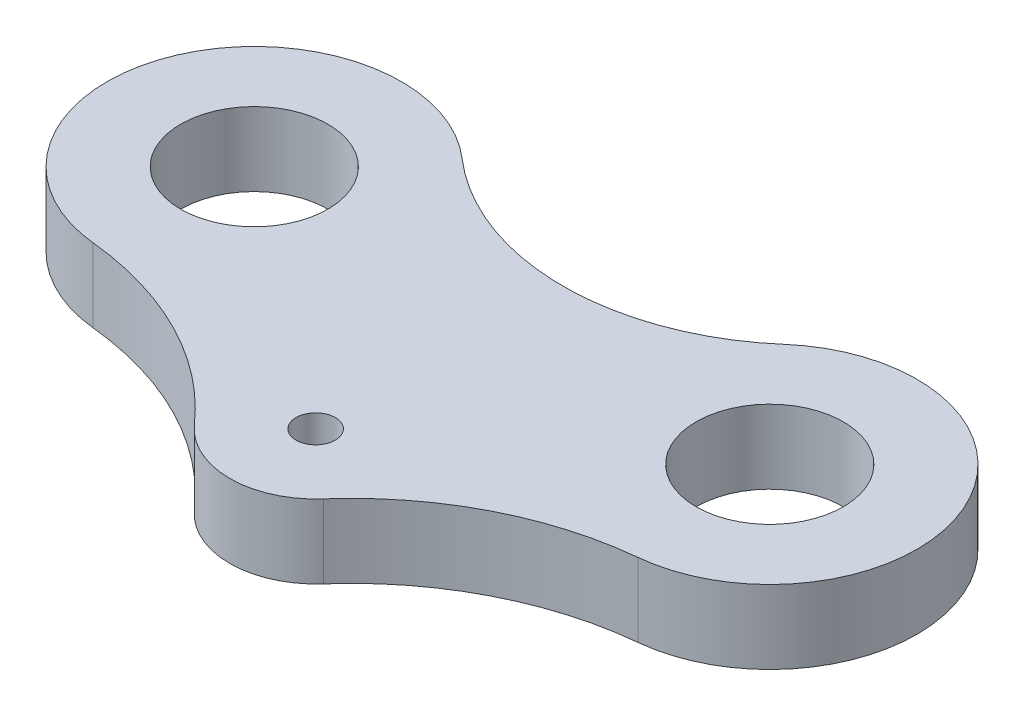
from build123d import *

# Parameters (mm, degrees)
CROQUIS1_R              = 15
CROQUIS1_R_2            = 4
SALIENTE_EXTRUIR1_DEPTH = 15


with BuildPart() as part:
    # Croquis1 → Saliente-Extruir1 (new body)
    with BuildSketch(Plane(origin=(0, 0, 0), x_dir=(1, 0, 0), z_dir=(0, 1, 0))):
        with BuildLine():
            ThreePointArc((-32.8125, 22.636305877), (-80.043353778, 11.889645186), (-55.470389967, -29.8525842))
            ThreePointArc((-55.470389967, -29.8525842), (-32.242544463, -36.696642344), (-13.131625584, -51.567644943))
            ThreePointArc((-13.131625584, -51.567644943), (0, -57.5), (13.131625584, -51.567644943))
            ThreePointArc((13.131625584, -51.567644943), (32.242544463, -36.696642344), (55.470389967, -29.8525842))
            ThreePointArc((55.470389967, -29.8525842), (80.043353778, 11.889645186), (32.8125, 22.636305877))
            ThreePointArc((32.8125, 22.636305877), (0, 10.363482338), (-32.8125, 22.636305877))
        make_face()
        with Locations(Location((-52.5, 0, 0), (0, 0, 270))):
            Circle(CROQUIS1_R, mode=Mode.SUBTRACT)
        with Locations(Location((52.5, 0, 0), (0, 0, 270))):
            Circle(CROQUIS1_R, mode=Mode.SUBTRACT)
        with Locations(Location((0, -40, 0), (0, 0, 270))):
            Circle(CROQUIS1_R_2, mode=Mode.SUBTRACT)
    extrude(amount=SALIENTE_EXTRUIR1_DEPTH)


solid = part.part
